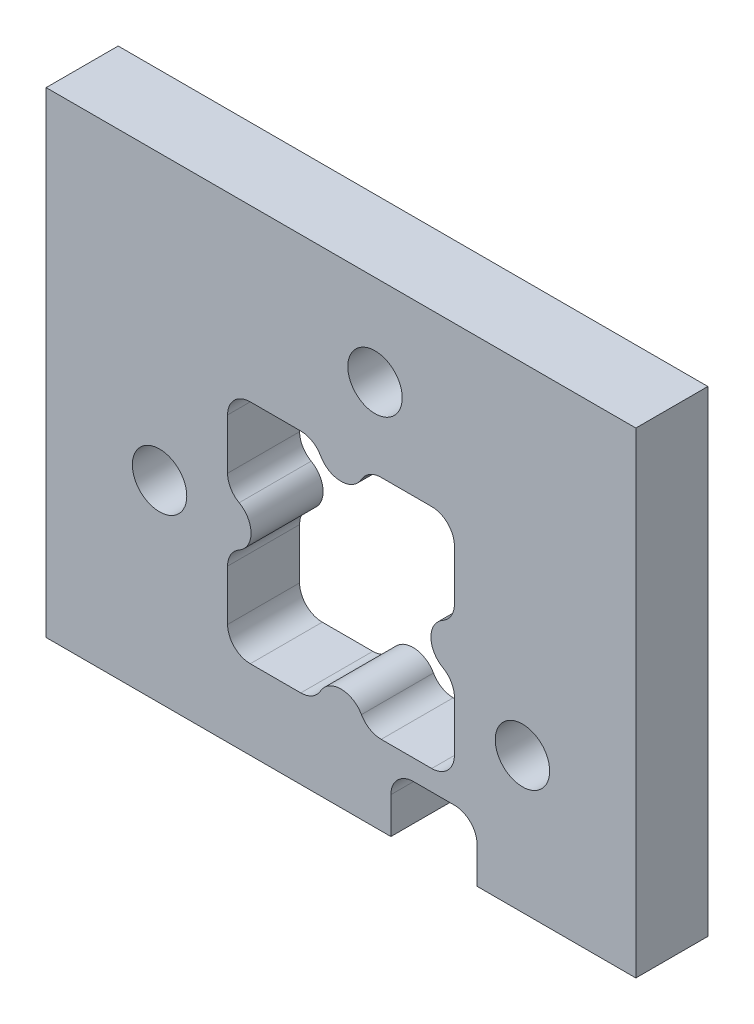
from build123d import *

# Parameters (mm, degrees)
BOSS_EXTRUDE1_DEPTH = 3.175
CUT_EXTRUDE1_DEPTH  = 20.047253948
FILLET1_R           = 1
SKETCH3_R           = 1.2
CUT_EXTRUDE2_DEPTH  = 20.047253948
FILLET2_R           = 1


with BuildPart() as part:
    # Sketch1 → Boss-Extrude1 (new body)
    with BuildSketch(Plane.XY):
        Polygon((-13.78398133, -12.756140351), (1.41601867, -12.756140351), (1.41601867, -10.156140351), (5.21601867, -10.156140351), (5.21601867, -12.756140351), (12.21601867, -12.756140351), (12.21601867, 8.243859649), (-13.78398133, 8.243859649), align=None)
    extrude(amount=BOSS_EXTRUDE1_DEPTH)

    # Sketch2 → Cut-Extrude1 (cut, through all)
    with BuildSketch(Plane.XY.offset(3.175)):
        with BuildLine():
            Line((4.21601867, -9.256140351), (0.251552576, -9.256140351))
            ThreePointArc((0.251552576, -9.256140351), (-0.78398133, -8.220606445), (-1.819515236, -9.256140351))
            Line((-1.819515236, -9.256140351), (-5.78398133, -9.256140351))
            Line((-5.78398133, -9.256140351), (-5.78398133, -5.291674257))
            ThreePointArc((-5.78398133, -5.291674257), (-4.748447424, -4.256140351), (-5.78398133, -3.220606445))
            Line((-5.78398133, -3.220606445), (-5.78398133, 0.743859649))
            Line((-5.78398133, 0.743859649), (-1.819515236, 0.743859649))
            ThreePointArc((-1.819515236, 0.743859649), (-0.78398133, -0.291674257), (0.251552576, 0.743859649))
            Line((0.251552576, 0.743859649), (4.21601867, 0.743859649))
            Line((4.21601867, 0.743859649), (4.21601867, -3.220606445))
            ThreePointArc((4.21601867, -3.220606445), (3.180484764, -4.256140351), (4.21601867, -5.291674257))
            Line((4.21601867, -5.291674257), (4.21601867, -9.256140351))
        make_face()
    extrude(amount=-CUT_EXTRUDE1_DEPTH, mode=Mode.SUBTRACT)

    # Fillet1
    fillet1_edges = [part.edges().sort_by_distance(p)[0] for p in [
        (4.21601867, 0.743859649, 1.5875),
        (4.21601867, -3.220606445, 1.5875),
        (4.21601867, -5.291674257, 1.5875),
        (4.21601867, -9.256140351, 1.5875),
        (0.251552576, -9.256140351, 1.5875),
        (-1.819515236, -9.256140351, 1.5875),
        (-5.78398133, -9.256140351, 1.5875),
        (-5.78398133, -5.291674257, 1.5875),
        (-5.78398133, -3.220606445, 1.5875),
        (-5.78398133, 0.743859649, 1.5875),
        (-1.819515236, 0.743859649, 1.5875),
        (0.251552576, 0.743859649, 1.5875),
    ]]
    fillet(fillet1_edges, radius=FILLET1_R)

    # Sketch3 → Cut-Extrude2 (cut, through all)
    with BuildSketch(Plane.XY.offset(3.175)):
        with Locations((7.21601867, -6.756140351)):
            Circle(SKETCH3_R)
        with Locations((0.71601867, 4.243859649)):
            Circle(SKETCH3_R)
        with Locations((-8.78398133, -4.256140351)):
            Circle(SKETCH3_R)
    extrude(amount=-CUT_EXTRUDE2_DEPTH, mode=Mode.SUBTRACT)

    # Fillet2
    fillet2_edges = [part.edges().sort_by_distance(p)[0] for p in [
        (5.21601867, -10.156140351, 1.5875),
        (1.41601867, -10.156140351, 1.5875),
    ]]
    fillet(fillet2_edges, radius=FILLET2_R)


solid = part.part
